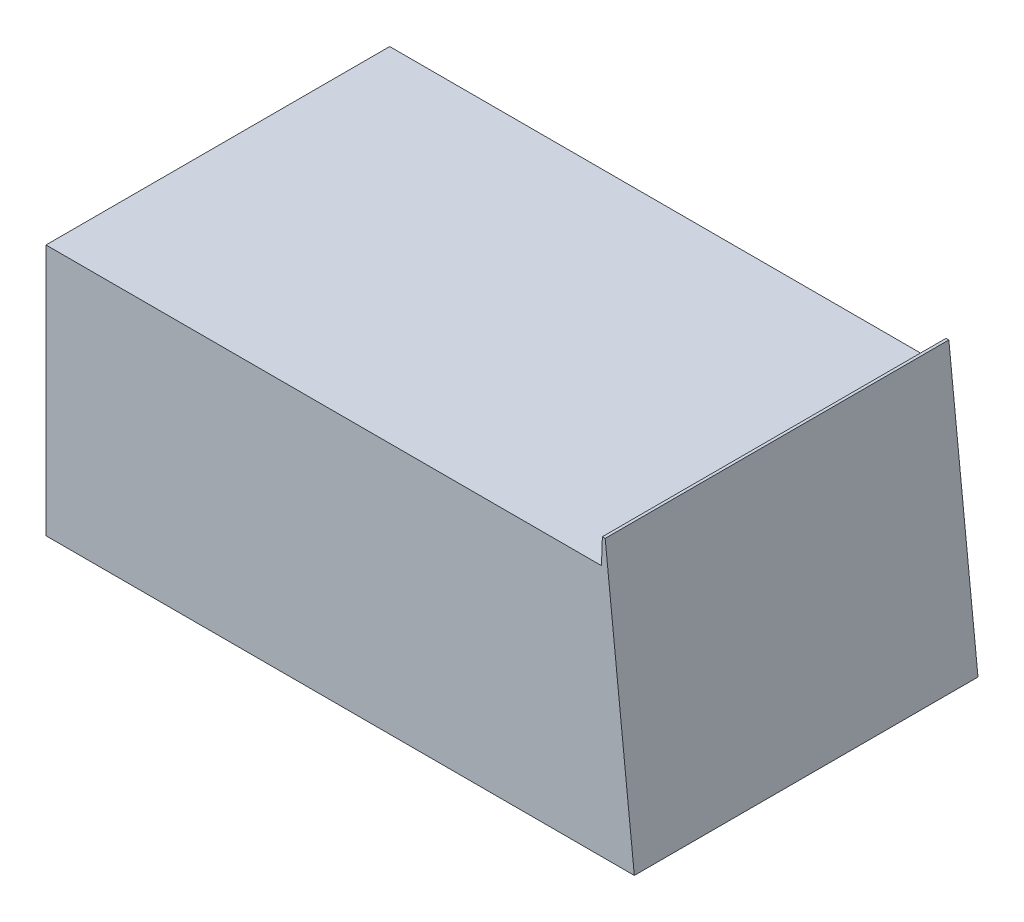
ISO-10303-21;
HEADER;
FILE_DESCRIPTION(('STEP AP214'),'2;1');
FILE_NAME('part.step','',(''),(''),'','','');
FILE_SCHEMA(('AUTOMOTIVE_DESIGN { 1 0 10303 214 1 1 1 1 }'));
ENDSEC;
DATA;
#1=APPLICATION_CONTEXT('core data for automotive mechanical design processes');
#2=APPLICATION_PROTOCOL_DEFINITION('international standard','automotive_design',2000,#1);
#3=PRODUCT_CONTEXT('',#1,'mechanical');
#4=PRODUCT('Part','Part','',(#3));
#5=PRODUCT_RELATED_PRODUCT_CATEGORY('part','',(#4));
#6=PRODUCT_DEFINITION_FORMATION('','',#4);
#7=PRODUCT_DEFINITION_CONTEXT('part definition',#1,'design');
#8=PRODUCT_DEFINITION('design','',#6,#7);
#9=PRODUCT_DEFINITION_SHAPE('','',#8);
#10=(LENGTH_UNIT() NAMED_UNIT(*) SI_UNIT(.MILLI.,.METRE.));
#11=(NAMED_UNIT(*) PLANE_ANGLE_UNIT() SI_UNIT($,.RADIAN.));
#12=(NAMED_UNIT(*) SI_UNIT($,.STERADIAN.) SOLID_ANGLE_UNIT());
#13=UNCERTAINTY_MEASURE_WITH_UNIT(LENGTH_MEASURE(1.E-05),#10,'distance_accuracy_value','');
#14=(GEOMETRIC_REPRESENTATION_CONTEXT(3) GLOBAL_UNCERTAINTY_ASSIGNED_CONTEXT((#13)) GLOBAL_UNIT_ASSIGNED_CONTEXT((#10,
#11,#12)) REPRESENTATION_CONTEXT('',''));
#15=CARTESIAN_POINT('',(0.,0.,0.));
#16=DIRECTION('',(0.,0.,1.));
#17=DIRECTION('',(1.,0.,0.));
#18=AXIS2_PLACEMENT_3D('',#15,#16,#17);
#19=CARTESIAN_POINT('',(-71.738034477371,79.,42.1231022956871));
#20=DIRECTION('',(0.,1.,0.));
#21=DIRECTION('',(0.,0.,1.));
#22=AXIS2_PLACEMENT_3D('',#19,#20,#21);
#23=PLANE('',#22);
#24=DIRECTION('',(1.,0.,0.));
#25=VECTOR('',#24,1.);
#26=CARTESIAN_POINT('',(-71.738034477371,79.,42.1231022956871));
#27=LINE('',#26,#25);
#28=CARTESIAN_POINT('',(-71.738034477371,79.,42.1231022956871));
#29=VERTEX_POINT('',#28);
#30=CARTESIAN_POINT('',(102.480009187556,79.,42.1231022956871));
#31=VERTEX_POINT('',#30);
#32=EDGE_CURVE('E159',#29,#31,#27,.T.);
#33=ORIENTED_EDGE('',*,*,#32,.T.);
#34=DIRECTION('',(0.,0.,-1.));
#35=VECTOR('',#34,1.);
#36=CARTESIAN_POINT('',(102.480009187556,79.,42.1231022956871));
#37=LINE('',#36,#35);
#38=CARTESIAN_POINT('',(102.480009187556,79.,-65.6678930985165));
#39=VERTEX_POINT('',#38);
#40=EDGE_CURVE('E183',#31,#39,#37,.T.);
#41=ORIENTED_EDGE('',*,*,#40,.T.);
#42=DIRECTION('',(-1.,0.,0.));
#43=VECTOR('',#42,1.);
#44=CARTESIAN_POINT('',(-71.738034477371,79.,-65.6678930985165));
#45=LINE('',#44,#43);
#46=CARTESIAN_POINT('',(-71.738034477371,79.,-65.6678930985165));
#47=VERTEX_POINT('',#46);
#48=EDGE_CURVE('E112',#39,#47,#45,.T.);
#49=ORIENTED_EDGE('',*,*,#48,.T.);
#50=DIRECTION('',(0.,0.,1.));
#51=VECTOR('',#50,1.);
#52=CARTESIAN_POINT('',(-71.738034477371,79.,-65.6678930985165));
#53=LINE('',#52,#51);
#54=EDGE_CURVE('E157',#47,#29,#53,.T.);
#55=ORIENTED_EDGE('',*,*,#54,.T.);
#56=EDGE_LOOP('',(#33,#41,#49,#55));
#57=FACE_BOUND('',#56,.T.);
#58=ADVANCED_FACE('F87',(#57),#23,.T.);
#59=CARTESIAN_POINT('',(-71.738034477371,79.,-65.6678930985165));
#60=DIRECTION('',(1.,0.,0.));
#61=DIRECTION('',(0.,0.,-1.));
#62=AXIS2_PLACEMENT_3D('',#59,#60,#61);
#63=PLANE('',#62);
#64=DIRECTION('',(0.,0.,1.));
#65=VECTOR('',#64,1.);
#66=CARTESIAN_POINT('',(-71.738034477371,0.,-65.6678930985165));
#67=LINE('',#66,#65);
#68=CARTESIAN_POINT('',(-71.738034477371,0.,-65.6678930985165));
#69=VERTEX_POINT('',#68);
#70=CARTESIAN_POINT('',(-71.738034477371,0.,42.1231022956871));
#71=VERTEX_POINT('',#70);
#72=EDGE_CURVE('E156',#69,#71,#67,.T.);
#73=ORIENTED_EDGE('',*,*,#72,.T.);
#74=DIRECTION('',(0.,-1.,0.));
#75=VECTOR('',#74,1.);
#76=CARTESIAN_POINT('',(-71.738034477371,79.,42.1231022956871));
#77=LINE('',#76,#75);
#78=EDGE_CURVE('E13',#29,#71,#77,.T.);
#79=ORIENTED_EDGE('',*,*,#78,.F.);
#80=ORIENTED_EDGE('',*,*,#54,.F.);
#81=DIRECTION('',(0.,-1.,0.));
#82=VECTOR('',#81,1.);
#83=CARTESIAN_POINT('',(-71.738034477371,79.,-65.6678930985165));
#84=LINE('',#83,#82);
#85=EDGE_CURVE('E151',#47,#69,#84,.T.);
#86=ORIENTED_EDGE('',*,*,#85,.T.);
#87=EDGE_LOOP('',(#73,#79,#80,#86));
#88=FACE_BOUND('',#87,.T.);
#89=ADVANCED_FACE('F207',(#88),#63,.F.);
#90=CARTESIAN_POINT('',(-71.738034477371,79.,42.1231022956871));
#91=DIRECTION('',(0.,0.,-1.));
#92=DIRECTION('',(-1.,0.,0.));
#93=AXIS2_PLACEMENT_3D('',#90,#91,#92);
#94=PLANE('',#93);
#95=DIRECTION('',(1.,0.,0.));
#96=VECTOR('',#95,1.);
#97=CARTESIAN_POINT('',(-71.738034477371,0.,42.1231022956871));
#98=LINE('',#97,#96);
#99=CARTESIAN_POINT('',(112.783243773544,0.,42.1231022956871));
#100=VERTEX_POINT('',#99);
#101=EDGE_CURVE('E143',#71,#100,#98,.T.);
#102=ORIENTED_EDGE('',*,*,#101,.T.);
#103=DIRECTION('',(-0.104528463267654,0.994521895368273,0.));
#104=VECTOR('',#103,1.);
#105=CARTESIAN_POINT('',(104.480009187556,79.,42.1231022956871));
#106=LINE('',#105,#104);
#107=CARTESIAN_POINT('',(103.63917530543,87.,42.1231022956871));
#108=VERTEX_POINT('',#107);
#109=EDGE_CURVE('E96',#108,#100,#106,.F.);
#110=ORIENTED_EDGE('',*,*,#109,.F.);
#111=DIRECTION('',(1.,0.,0.));
#112=VECTOR('',#111,1.);
#113=CARTESIAN_POINT('',(-71.738034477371,87.,42.1231022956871));
#114=LINE('',#113,#112);
#115=CARTESIAN_POINT('',(102.75937534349,87.,42.1231022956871));
#116=VERTEX_POINT('',#115);
#117=EDGE_CURVE('E186',#116,#108,#114,.T.);
#118=ORIENTED_EDGE('',*,*,#117,.F.);
#119=DIRECTION('',(-0.0348994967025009,-0.999390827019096,0.));
#120=VECTOR('',#119,1.);
#121=CARTESIAN_POINT('',(102.480009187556,79.,42.1231022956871));
#122=LINE('',#121,#120);
#123=EDGE_CURVE('E191',#116,#31,#122,.T.);
#124=ORIENTED_EDGE('',*,*,#123,.T.);
#125=ORIENTED_EDGE('',*,*,#32,.F.);
#126=ORIENTED_EDGE('',*,*,#78,.T.);
#127=EDGE_LOOP('',(#102,#110,#118,#124,#125,#126));
#128=FACE_BOUND('',#127,.T.);
#129=ADVANCED_FACE('F202',(#128),#94,.F.);
#130=CARTESIAN_POINT('',(104.480009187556,79.,-65.6678930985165));
#131=DIRECTION('',(0.994521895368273,0.104528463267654,0.));
#132=DIRECTION('',(-0.104528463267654,0.994521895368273,0.));
#133=AXIS2_PLACEMENT_3D('',#130,#131,#132);
#134=PLANE('',#133);
#135=DIRECTION('',(0.,0.,1.));
#136=VECTOR('',#135,1.);
#137=CARTESIAN_POINT('',(112.783243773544,0.,-65.6678930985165));
#138=LINE('',#137,#136);
#139=CARTESIAN_POINT('',(112.783243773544,0.,-65.6678930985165));
#140=VERTEX_POINT('',#139);
#141=EDGE_CURVE('E133',#100,#140,#138,.F.);
#142=ORIENTED_EDGE('',*,*,#141,.T.);
#143=DIRECTION('',(-0.104528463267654,0.994521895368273,0.));
#144=VECTOR('',#143,1.);
#145=CARTESIAN_POINT('',(102.554615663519,97.3188957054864,-65.6678930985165));
#146=LINE('',#145,#144);
#147=CARTESIAN_POINT('',(103.63917530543,87.,-65.6678930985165));
#148=VERTEX_POINT('',#147);
#149=EDGE_CURVE('E137',#148,#140,#146,.F.);
#150=ORIENTED_EDGE('',*,*,#149,.F.);
#151=DIRECTION('',(0.,0.,-1.));
#152=VECTOR('',#151,1.);
#153=CARTESIAN_POINT('',(103.63917530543,87.,42.1231022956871));
#154=LINE('',#153,#152);
#155=EDGE_CURVE('E180',#148,#108,#154,.F.);
#156=ORIENTED_EDGE('',*,*,#155,.T.);
#157=ORIENTED_EDGE('',*,*,#109,.T.);
#158=EDGE_LOOP('',(#142,#150,#156,#157));
#159=FACE_BOUND('',#158,.T.);
#160=ADVANCED_FACE('F89',(#159),#134,.T.);
#161=CARTESIAN_POINT('',(-71.738034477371,79.,-65.6678930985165));
#162=DIRECTION('',(0.,0.,1.));
#163=DIRECTION('',(1.,0.,0.));
#164=AXIS2_PLACEMENT_3D('',#161,#162,#163);
#165=PLANE('',#164);
#166=DIRECTION('',(-1.,0.,0.));
#167=VECTOR('',#166,1.);
#168=CARTESIAN_POINT('',(-71.738034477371,0.,-65.6678930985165));
#169=LINE('',#168,#167);
#170=EDGE_CURVE('E142',#140,#69,#169,.T.);
#171=ORIENTED_EDGE('',*,*,#170,.T.);
#172=ORIENTED_EDGE('',*,*,#85,.F.);
#173=ORIENTED_EDGE('',*,*,#48,.F.);
#174=DIRECTION('',(-0.0348994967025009,-0.999390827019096,0.));
#175=VECTOR('',#174,1.);
#176=CARTESIAN_POINT('',(102.546841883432,80.9138380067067,-65.6678930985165));
#177=LINE('',#176,#175);
#178=CARTESIAN_POINT('',(102.75937534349,87.,-65.6678930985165));
#179=VERTEX_POINT('',#178);
#180=EDGE_CURVE('E104',#179,#39,#177,.T.);
#181=ORIENTED_EDGE('',*,*,#180,.F.);
#182=DIRECTION('',(-1.,0.,0.));
#183=VECTOR('',#182,1.);
#184=CARTESIAN_POINT('',(-71.738034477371,87.,-65.6678930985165));
#185=LINE('',#184,#183);
#186=EDGE_CURVE('E150',#148,#179,#185,.T.);
#187=ORIENTED_EDGE('',*,*,#186,.F.);
#188=ORIENTED_EDGE('',*,*,#149,.T.);
#189=EDGE_LOOP('',(#171,#172,#173,#181,#187,#188));
#190=FACE_BOUND('',#189,.T.);
#191=ADVANCED_FACE('F147',(#190),#165,.F.);
#192=CARTESIAN_POINT('',(-71.738034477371,0.,42.1231022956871));
#193=DIRECTION('',(0.,1.,0.));
#194=DIRECTION('',(0.,0.,1.));
#195=AXIS2_PLACEMENT_3D('',#192,#193,#194);
#196=PLANE('',#195);
#197=ORIENTED_EDGE('',*,*,#72,.F.);
#198=ORIENTED_EDGE('',*,*,#170,.F.);
#199=ORIENTED_EDGE('',*,*,#141,.F.);
#200=ORIENTED_EDGE('',*,*,#101,.F.);
#201=EDGE_LOOP('',(#197,#198,#199,#200));
#202=FACE_BOUND('',#201,.T.);
#203=ADVANCED_FACE('F154',(#202),#196,.F.);
#204=CARTESIAN_POINT('',(102.480009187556,79.,42.1231022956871));
#205=DIRECTION('',(-0.999390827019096,0.0348994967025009,0.));
#206=DIRECTION('',(-0.0348994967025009,-0.999390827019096,0.));
#207=AXIS2_PLACEMENT_3D('',#204,#205,#206);
#208=PLANE('',#207);
#209=ORIENTED_EDGE('',*,*,#40,.F.);
#210=ORIENTED_EDGE('',*,*,#123,.F.);
#211=DIRECTION('',(0.,0.,-1.));
#212=VECTOR('',#211,1.);
#213=CARTESIAN_POINT('',(102.75937534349,87.,42.1231022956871));
#214=LINE('',#213,#212);
#215=EDGE_CURVE('E189',#116,#179,#214,.T.);
#216=ORIENTED_EDGE('',*,*,#215,.T.);
#217=ORIENTED_EDGE('',*,*,#180,.T.);
#218=EDGE_LOOP('',(#209,#210,#216,#217));
#219=FACE_BOUND('',#218,.T.);
#220=ADVANCED_FACE('F205',(#219),#208,.T.);
#221=CARTESIAN_POINT('',(-71.738034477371,87.,42.1231022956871));
#222=DIRECTION('',(0.,1.,0.));
#223=DIRECTION('',(0.,0.,1.));
#224=AXIS2_PLACEMENT_3D('',#221,#222,#223);
#225=PLANE('',#224);
#226=ORIENTED_EDGE('',*,*,#155,.F.);
#227=ORIENTED_EDGE('',*,*,#186,.T.);
#228=ORIENTED_EDGE('',*,*,#215,.F.);
#229=ORIENTED_EDGE('',*,*,#117,.T.);
#230=EDGE_LOOP('',(#226,#227,#228,#229));
#231=FACE_BOUND('',#230,.T.);
#232=ADVANCED_FACE('F210',(#231),#225,.T.);
#233=CLOSED_SHELL('',(#58,#89,#129,#160,#191,#203,#220,#232));
#234=MANIFOLD_SOLID_BREP('B2',#233);
#235=ADVANCED_BREP_SHAPE_REPRESENTATION('',(#18,#234),#14);
#236=SHAPE_DEFINITION_REPRESENTATION(#9,#235);
ENDSEC;
END-ISO-10303-21;
